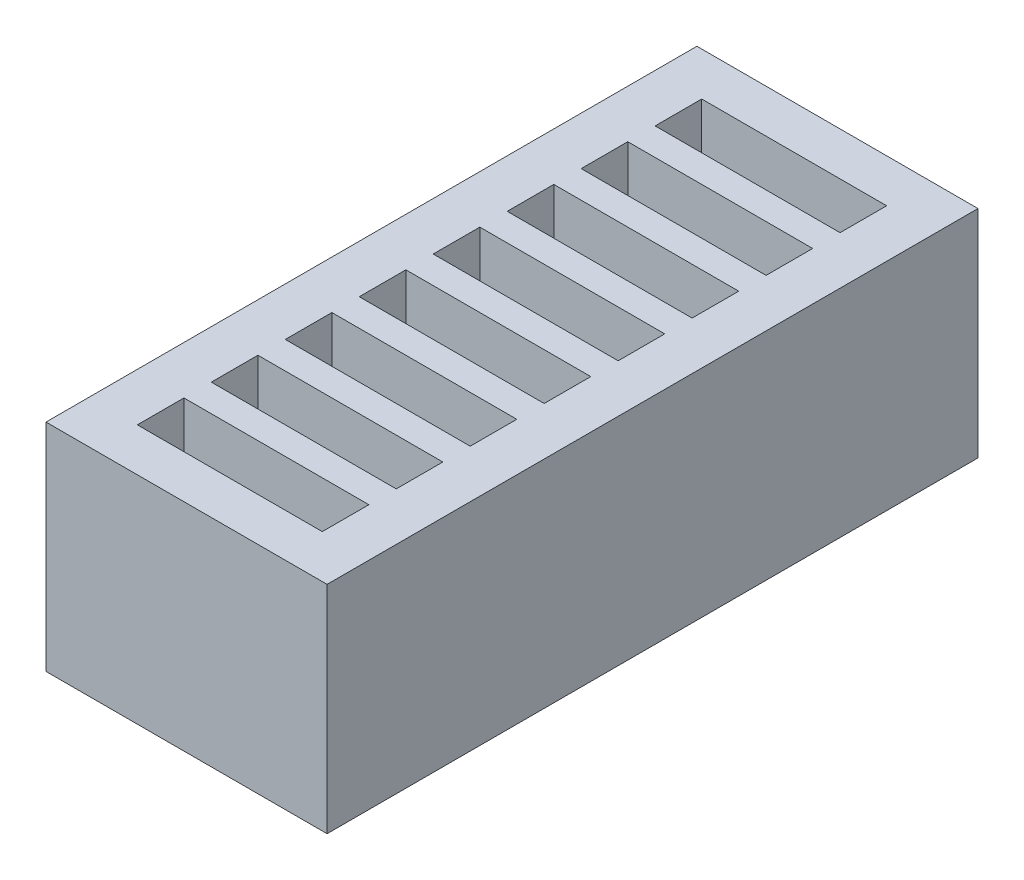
ISO-10303-21;
HEADER;
FILE_DESCRIPTION(('STEP AP214'),'2;1');
FILE_NAME('part.step','',(''),(''),'','','');
FILE_SCHEMA(('AUTOMOTIVE_DESIGN { 1 0 10303 214 1 1 1 1 }'));
ENDSEC;
DATA;
#1=APPLICATION_CONTEXT('core data for automotive mechanical design processes');
#2=APPLICATION_PROTOCOL_DEFINITION('international standard','automotive_design',2000,#1);
#3=PRODUCT_CONTEXT('',#1,'mechanical');
#4=PRODUCT('Part','Part','',(#3));
#5=PRODUCT_RELATED_PRODUCT_CATEGORY('part','',(#4));
#6=PRODUCT_DEFINITION_FORMATION('','',#4);
#7=PRODUCT_DEFINITION_CONTEXT('part definition',#1,'design');
#8=PRODUCT_DEFINITION('design','',#6,#7);
#9=PRODUCT_DEFINITION_SHAPE('','',#8);
#10=(LENGTH_UNIT() NAMED_UNIT(*) SI_UNIT(.MILLI.,.METRE.));
#11=(NAMED_UNIT(*) PLANE_ANGLE_UNIT() SI_UNIT($,.RADIAN.));
#12=(NAMED_UNIT(*) SI_UNIT($,.STERADIAN.) SOLID_ANGLE_UNIT());
#13=UNCERTAINTY_MEASURE_WITH_UNIT(LENGTH_MEASURE(1.E-05),#10,'distance_accuracy_value','');
#14=(GEOMETRIC_REPRESENTATION_CONTEXT(3) GLOBAL_UNCERTAINTY_ASSIGNED_CONTEXT((#13)) GLOBAL_UNIT_ASSIGNED_CONTEXT((#10,
#11,#12)) REPRESENTATION_CONTEXT('',''));
#15=CARTESIAN_POINT('',(0.,0.,0.));
#16=DIRECTION('',(0.,0.,1.));
#17=DIRECTION('',(1.,0.,0.));
#18=AXIS2_PLACEMENT_3D('',#15,#16,#17);
#19=CARTESIAN_POINT('',(0.,7.4168,0.));
#20=DIRECTION('',(1.,0.,0.));
#21=DIRECTION('',(0.,0.,-1.));
#22=AXIS2_PLACEMENT_3D('',#19,#20,#21);
#23=PLANE('',#22);
#24=DIRECTION('',(0.,0.,1.));
#25=VECTOR('',#24,1.);
#26=CARTESIAN_POINT('',(0.,0.,0.));
#27=LINE('',#26,#25);
#28=CARTESIAN_POINT('',(0.,0.,-22.352));
#29=VERTEX_POINT('',#28);
#30=CARTESIAN_POINT('',(0.,0.,0.));
#31=VERTEX_POINT('',#30);
#32=EDGE_CURVE('E518',#29,#31,#27,.T.);
#33=ORIENTED_EDGE('',*,*,#32,.T.);
#34=DIRECTION('',(0.,-1.,0.));
#35=VECTOR('',#34,1.);
#36=CARTESIAN_POINT('',(0.,7.4168,0.));
#37=LINE('',#36,#35);
#38=CARTESIAN_POINT('',(0.,7.4168,0.));
#39=VERTEX_POINT('',#38);
#40=EDGE_CURVE('E11',#39,#31,#37,.T.);
#41=ORIENTED_EDGE('',*,*,#40,.F.);
#42=DIRECTION('',(0.,0.,1.));
#43=VECTOR('',#42,1.);
#44=CARTESIAN_POINT('',(0.,7.4168,0.));
#45=LINE('',#44,#43);
#46=CARTESIAN_POINT('',(0.,7.4168,-22.352));
#47=VERTEX_POINT('',#46);
#48=EDGE_CURVE('E533',#47,#39,#45,.T.);
#49=ORIENTED_EDGE('',*,*,#48,.F.);
#50=DIRECTION('',(0.,-1.,0.));
#51=VECTOR('',#50,1.);
#52=CARTESIAN_POINT('',(0.,7.4168,-22.352));
#53=LINE('',#52,#51);
#54=EDGE_CURVE('E542',#47,#29,#53,.T.);
#55=ORIENTED_EDGE('',*,*,#54,.T.);
#56=EDGE_LOOP('',(#33,#41,#49,#55));
#57=FACE_BOUND('',#56,.T.);
#58=ADVANCED_FACE('F30',(#57),#23,.F.);
#59=CARTESIAN_POINT('',(0.,7.4168,0.));
#60=DIRECTION('',(0.,0.,-1.));
#61=DIRECTION('',(-1.,0.,0.));
#62=AXIS2_PLACEMENT_3D('',#59,#60,#61);
#63=PLANE('',#62);
#64=DIRECTION('',(1.,0.,0.));
#65=VECTOR('',#64,1.);
#66=CARTESIAN_POINT('',(0.,0.,0.));
#67=LINE('',#66,#65);
#68=CARTESIAN_POINT('',(9.652,0.,0.));
#69=VERTEX_POINT('',#68);
#70=EDGE_CURVE('E527',#31,#69,#67,.T.);
#71=ORIENTED_EDGE('',*,*,#70,.T.);
#72=DIRECTION('',(0.,-1.,0.));
#73=VECTOR('',#72,1.);
#74=CARTESIAN_POINT('',(9.652,7.4168,0.));
#75=LINE('',#74,#73);
#76=CARTESIAN_POINT('',(9.652,7.4168,0.));
#77=VERTEX_POINT('',#76);
#78=EDGE_CURVE('E37',#77,#69,#75,.T.);
#79=ORIENTED_EDGE('',*,*,#78,.F.);
#80=DIRECTION('',(1.,0.,0.));
#81=VECTOR('',#80,1.);
#82=CARTESIAN_POINT('',(0.,7.4168,0.));
#83=LINE('',#82,#81);
#84=EDGE_CURVE('E536',#39,#77,#83,.T.);
#85=ORIENTED_EDGE('',*,*,#84,.F.);
#86=ORIENTED_EDGE('',*,*,#40,.T.);
#87=EDGE_LOOP('',(#71,#79,#85,#86));
#88=FACE_BOUND('',#87,.T.);
#89=ADVANCED_FACE('F567',(#88),#63,.F.);
#90=CARTESIAN_POINT('',(9.652,7.4168,0.));
#91=DIRECTION('',(-1.,0.,0.));
#92=DIRECTION('',(0.,0.,1.));
#93=AXIS2_PLACEMENT_3D('',#90,#91,#92);
#94=PLANE('',#93);
#95=DIRECTION('',(0.,0.,-1.));
#96=VECTOR('',#95,1.);
#97=CARTESIAN_POINT('',(9.652,0.,0.));
#98=LINE('',#97,#96);
#99=CARTESIAN_POINT('',(9.652,0.,-22.352));
#100=VERTEX_POINT('',#99);
#101=EDGE_CURVE('E529',#69,#100,#98,.T.);
#102=ORIENTED_EDGE('',*,*,#101,.T.);
#103=DIRECTION('',(0.,-1.,0.));
#104=VECTOR('',#103,1.);
#105=CARTESIAN_POINT('',(9.652,7.4168,-22.352));
#106=LINE('',#105,#104);
#107=CARTESIAN_POINT('',(9.652,7.4168,-22.352));
#108=VERTEX_POINT('',#107);
#109=EDGE_CURVE('E545',#108,#100,#106,.T.);
#110=ORIENTED_EDGE('',*,*,#109,.F.);
#111=DIRECTION('',(0.,0.,-1.));
#112=VECTOR('',#111,1.);
#113=CARTESIAN_POINT('',(9.652,7.4168,0.));
#114=LINE('',#113,#112);
#115=EDGE_CURVE('E538',#77,#108,#114,.T.);
#116=ORIENTED_EDGE('',*,*,#115,.F.);
#117=ORIENTED_EDGE('',*,*,#78,.T.);
#118=EDGE_LOOP('',(#102,#110,#116,#117));
#119=FACE_BOUND('',#118,.T.);
#120=ADVANCED_FACE('F552',(#119),#94,.F.);
#121=CARTESIAN_POINT('',(0.,7.4168,-22.352));
#122=DIRECTION('',(0.,0.,1.));
#123=DIRECTION('',(1.,0.,0.));
#124=AXIS2_PLACEMENT_3D('',#121,#122,#123);
#125=PLANE('',#124);
#126=DIRECTION('',(-1.,0.,0.));
#127=VECTOR('',#126,1.);
#128=CARTESIAN_POINT('',(0.,0.,-22.352));
#129=LINE('',#128,#127);
#130=EDGE_CURVE('E531',#100,#29,#129,.T.);
#131=ORIENTED_EDGE('',*,*,#130,.T.);
#132=ORIENTED_EDGE('',*,*,#54,.F.);
#133=DIRECTION('',(-1.,0.,0.));
#134=VECTOR('',#133,1.);
#135=CARTESIAN_POINT('',(0.,7.4168,-22.352));
#136=LINE('',#135,#134);
#137=EDGE_CURVE('E540',#108,#47,#136,.T.);
#138=ORIENTED_EDGE('',*,*,#137,.F.);
#139=ORIENTED_EDGE('',*,*,#109,.T.);
#140=EDGE_LOOP('',(#131,#132,#138,#139));
#141=FACE_BOUND('',#140,.T.);
#142=ADVANCED_FACE('F561',(#141),#125,.F.);
#143=CARTESIAN_POINT('',(0.,7.4168,-22.352));
#144=DIRECTION('',(0.,-1.,0.));
#145=DIRECTION('',(0.,0.,-1.));
#146=AXIS2_PLACEMENT_3D('',#143,#144,#145);
#147=PLANE('',#146);
#148=DIRECTION('',(0.,0.,1.));
#149=VECTOR('',#148,1.);
#150=CARTESIAN_POINT('',(1.651,7.4168,-13.2461));
#151=LINE('',#150,#149);
#152=CARTESIAN_POINT('',(1.651,7.4168,-13.2461));
#153=VERTEX_POINT('',#152);
#154=CARTESIAN_POINT('',(1.651,7.4168,-11.6459));
#155=VERTEX_POINT('',#154);
#156=EDGE_CURVE('E277',#153,#155,#151,.T.);
#157=ORIENTED_EDGE('',*,*,#156,.F.);
#158=DIRECTION('',(-1.,0.,0.));
#159=VECTOR('',#158,1.);
#160=CARTESIAN_POINT('',(8.001,7.4168,-13.2461));
#161=LINE('',#160,#159);
#162=CARTESIAN_POINT('',(8.001,7.4168,-13.2461));
#163=VERTEX_POINT('',#162);
#164=EDGE_CURVE('E44',#163,#153,#161,.T.);
#165=ORIENTED_EDGE('',*,*,#164,.F.);
#166=DIRECTION('',(0.,0.,-1.));
#167=VECTOR('',#166,1.);
#168=CARTESIAN_POINT('',(8.001,7.4168,-13.2461));
#169=LINE('',#168,#167);
#170=CARTESIAN_POINT('',(8.001,7.4168,-11.6459));
#171=VERTEX_POINT('',#170);
#172=EDGE_CURVE('E284',#171,#163,#169,.T.);
#173=ORIENTED_EDGE('',*,*,#172,.F.);
#174=DIRECTION('',(1.,0.,0.));
#175=VECTOR('',#174,1.);
#176=CARTESIAN_POINT('',(8.001,7.4168,-11.6459));
#177=LINE('',#176,#175);
#178=EDGE_CURVE('E266',#155,#171,#177,.T.);
#179=ORIENTED_EDGE('',*,*,#178,.F.);
#180=EDGE_LOOP('',(#157,#165,#173,#179));
#181=FACE_BOUND('',#180,.T.);
#182=DIRECTION('',(0.,0.,1.));
#183=VECTOR('',#182,1.);
#184=CARTESIAN_POINT('',(1.65100000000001,7.4168,-15.7861));
#185=LINE('',#184,#183);
#186=CARTESIAN_POINT('',(1.65100000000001,7.4168,-15.7861));
#187=VERTEX_POINT('',#186);
#188=CARTESIAN_POINT('',(1.65100000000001,7.4168,-14.1859));
#189=VERTEX_POINT('',#188);
#190=EDGE_CURVE('E303',#187,#189,#185,.T.);
#191=ORIENTED_EDGE('',*,*,#190,.F.);
#192=DIRECTION('',(-1.,0.,0.));
#193=VECTOR('',#192,1.);
#194=CARTESIAN_POINT('',(8.00100000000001,7.4168,-15.7861));
#195=LINE('',#194,#193);
#196=CARTESIAN_POINT('',(8.00100000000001,7.4168,-15.7861));
#197=VERTEX_POINT('',#196);
#198=EDGE_CURVE('E52',#197,#187,#195,.T.);
#199=ORIENTED_EDGE('',*,*,#198,.F.);
#200=DIRECTION('',(0.,0.,-1.));
#201=VECTOR('',#200,1.);
#202=CARTESIAN_POINT('',(8.00100000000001,7.4168,-15.7861));
#203=LINE('',#202,#201);
#204=CARTESIAN_POINT('',(8.00100000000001,7.4168,-14.1859));
#205=VERTEX_POINT('',#204);
#206=EDGE_CURVE('E309',#205,#197,#203,.T.);
#207=ORIENTED_EDGE('',*,*,#206,.F.);
#208=DIRECTION('',(1.,0.,0.));
#209=VECTOR('',#208,1.);
#210=CARTESIAN_POINT('',(8.00100000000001,7.4168,-14.1859));
#211=LINE('',#210,#209);
#212=EDGE_CURVE('E306',#189,#205,#211,.T.);
#213=ORIENTED_EDGE('',*,*,#212,.F.);
#214=EDGE_LOOP('',(#191,#199,#207,#213));
#215=FACE_BOUND('',#214,.T.);
#216=DIRECTION('',(0.,0.,1.));
#217=VECTOR('',#216,1.);
#218=CARTESIAN_POINT('',(1.65100000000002,7.4168,-18.3261));
#219=LINE('',#218,#217);
#220=CARTESIAN_POINT('',(1.65100000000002,7.4168,-18.3261));
#221=VERTEX_POINT('',#220);
#222=CARTESIAN_POINT('',(1.65100000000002,7.4168,-16.7259));
#223=VERTEX_POINT('',#222);
#224=EDGE_CURVE('E334',#221,#223,#219,.T.);
#225=ORIENTED_EDGE('',*,*,#224,.F.);
#226=DIRECTION('',(-1.,0.,0.));
#227=VECTOR('',#226,1.);
#228=CARTESIAN_POINT('',(8.00100000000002,7.4168,-18.3261));
#229=LINE('',#228,#227);
#230=CARTESIAN_POINT('',(8.00100000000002,7.4168,-18.3261));
#231=VERTEX_POINT('',#230);
#232=EDGE_CURVE('E327',#231,#221,#229,.T.);
#233=ORIENTED_EDGE('',*,*,#232,.F.);
#234=DIRECTION('',(0.,0.,-1.));
#235=VECTOR('',#234,1.);
#236=CARTESIAN_POINT('',(8.00100000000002,7.4168,-18.3261));
#237=LINE('',#236,#235);
#238=CARTESIAN_POINT('',(8.00100000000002,7.4168,-16.7259));
#239=VERTEX_POINT('',#238);
#240=EDGE_CURVE('E340',#239,#231,#237,.T.);
#241=ORIENTED_EDGE('',*,*,#240,.F.);
#242=DIRECTION('',(1.,0.,0.));
#243=VECTOR('',#242,1.);
#244=CARTESIAN_POINT('',(8.00100000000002,7.4168,-16.7259));
#245=LINE('',#244,#243);
#246=EDGE_CURVE('E337',#223,#239,#245,.T.);
#247=ORIENTED_EDGE('',*,*,#246,.F.);
#248=EDGE_LOOP('',(#225,#233,#241,#247));
#249=FACE_BOUND('',#248,.T.);
#250=DIRECTION('',(-1.,0.,0.));
#251=VECTOR('',#250,1.);
#252=CARTESIAN_POINT('',(8.00100000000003,7.4168,-3.0861));
#253=LINE('',#252,#251);
#254=CARTESIAN_POINT('',(8.00100000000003,7.4168,-3.0861));
#255=VERTEX_POINT('',#254);
#256=CARTESIAN_POINT('',(1.65100000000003,7.4168,-3.0861));
#257=VERTEX_POINT('',#256);
#258=EDGE_CURVE('E366',#255,#257,#253,.T.);
#259=ORIENTED_EDGE('',*,*,#258,.F.);
#260=DIRECTION('',(0.,0.,-1.));
#261=VECTOR('',#260,1.);
#262=CARTESIAN_POINT('',(8.00100000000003,7.4168,-1.4859));
#263=LINE('',#262,#261);
#264=CARTESIAN_POINT('',(8.00100000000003,7.4168,-1.4859));
#265=VERTEX_POINT('',#264);
#266=EDGE_CURVE('E358',#265,#255,#263,.T.);
#267=ORIENTED_EDGE('',*,*,#266,.F.);
#268=DIRECTION('',(1.,0.,0.));
#269=VECTOR('',#268,1.);
#270=CARTESIAN_POINT('',(8.00100000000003,7.4168,-1.4859));
#271=LINE('',#270,#269);
#272=CARTESIAN_POINT('',(1.65100000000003,7.4168,-1.4859));
#273=VERTEX_POINT('',#272);
#274=EDGE_CURVE('E372',#273,#265,#271,.T.);
#275=ORIENTED_EDGE('',*,*,#274,.F.);
#276=DIRECTION('',(0.,0.,1.));
#277=VECTOR('',#276,1.);
#278=CARTESIAN_POINT('',(1.65100000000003,7.4168,-1.4859));
#279=LINE('',#278,#277);
#280=EDGE_CURVE('E369',#257,#273,#279,.T.);
#281=ORIENTED_EDGE('',*,*,#280,.F.);
#282=EDGE_LOOP('',(#259,#267,#275,#281));
#283=FACE_BOUND('',#282,.T.);
#284=DIRECTION('',(-1.,0.,0.));
#285=VECTOR('',#284,1.);
#286=CARTESIAN_POINT('',(8.00100000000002,7.4168,-5.6261));
#287=LINE('',#286,#285);
#288=CARTESIAN_POINT('',(8.00100000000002,7.4168,-5.6261));
#289=VERTEX_POINT('',#288);
#290=CARTESIAN_POINT('',(1.65100000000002,7.4168,-5.6261));
#291=VERTEX_POINT('',#290);
#292=EDGE_CURVE('E398',#289,#291,#287,.T.);
#293=ORIENTED_EDGE('',*,*,#292,.F.);
#294=DIRECTION('',(0.,0.,-1.));
#295=VECTOR('',#294,1.);
#296=CARTESIAN_POINT('',(8.00100000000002,7.4168,-4.0259));
#297=LINE('',#296,#295);
#298=CARTESIAN_POINT('',(8.00100000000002,7.4168,-4.0259));
#299=VERTEX_POINT('',#298);
#300=EDGE_CURVE('E390',#299,#289,#297,.T.);
#301=ORIENTED_EDGE('',*,*,#300,.F.);
#302=DIRECTION('',(1.,0.,0.));
#303=VECTOR('',#302,1.);
#304=CARTESIAN_POINT('',(8.00100000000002,7.4168,-4.0259));
#305=LINE('',#304,#303);
#306=CARTESIAN_POINT('',(1.65100000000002,7.4168,-4.0259));
#307=VERTEX_POINT('',#306);
#308=EDGE_CURVE('E404',#307,#299,#305,.T.);
#309=ORIENTED_EDGE('',*,*,#308,.F.);
#310=DIRECTION('',(0.,0.,1.));
#311=VECTOR('',#310,1.);
#312=CARTESIAN_POINT('',(1.65100000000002,7.4168,-4.0259));
#313=LINE('',#312,#311);
#314=EDGE_CURVE('E401',#291,#307,#313,.T.);
#315=ORIENTED_EDGE('',*,*,#314,.F.);
#316=EDGE_LOOP('',(#293,#301,#309,#315));
#317=FACE_BOUND('',#316,.T.);
#318=DIRECTION('',(-1.,0.,0.));
#319=VECTOR('',#318,1.);
#320=CARTESIAN_POINT('',(8.00100000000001,7.4168,-8.1661));
#321=LINE('',#320,#319);
#322=CARTESIAN_POINT('',(8.00100000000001,7.4168,-8.1661));
#323=VERTEX_POINT('',#322);
#324=CARTESIAN_POINT('',(1.65100000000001,7.4168,-8.1661));
#325=VERTEX_POINT('',#324);
#326=EDGE_CURVE('E430',#323,#325,#321,.T.);
#327=ORIENTED_EDGE('',*,*,#326,.F.);
#328=DIRECTION('',(0.,0.,-1.));
#329=VECTOR('',#328,1.);
#330=CARTESIAN_POINT('',(8.00100000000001,7.4168,-6.5659));
#331=LINE('',#330,#329);
#332=CARTESIAN_POINT('',(8.00100000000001,7.4168,-6.5659));
#333=VERTEX_POINT('',#332);
#334=EDGE_CURVE('E422',#333,#323,#331,.T.);
#335=ORIENTED_EDGE('',*,*,#334,.F.);
#336=DIRECTION('',(1.,0.,0.));
#337=VECTOR('',#336,1.);
#338=CARTESIAN_POINT('',(8.00100000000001,7.4168,-6.5659));
#339=LINE('',#338,#337);
#340=CARTESIAN_POINT('',(1.65100000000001,7.4168,-6.5659));
#341=VERTEX_POINT('',#340);
#342=EDGE_CURVE('E436',#341,#333,#339,.T.);
#343=ORIENTED_EDGE('',*,*,#342,.F.);
#344=DIRECTION('',(0.,0.,1.));
#345=VECTOR('',#344,1.);
#346=CARTESIAN_POINT('',(1.65100000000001,7.4168,-6.5659));
#347=LINE('',#346,#345);
#348=EDGE_CURVE('E433',#325,#341,#347,.T.);
#349=ORIENTED_EDGE('',*,*,#348,.F.);
#350=EDGE_LOOP('',(#327,#335,#343,#349));
#351=FACE_BOUND('',#350,.T.);
#352=DIRECTION('',(0.,0.,1.));
#353=VECTOR('',#352,1.);
#354=CARTESIAN_POINT('',(1.65100000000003,7.4168,-20.8661));
#355=LINE('',#354,#353);
#356=CARTESIAN_POINT('',(1.65100000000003,7.4168,-20.8661));
#357=VERTEX_POINT('',#356);
#358=CARTESIAN_POINT('',(1.65100000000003,7.4168,-19.2659));
#359=VERTEX_POINT('',#358);
#360=EDGE_CURVE('E462',#357,#359,#355,.T.);
#361=ORIENTED_EDGE('',*,*,#360,.F.);
#362=DIRECTION('',(-1.,0.,0.));
#363=VECTOR('',#362,1.);
#364=CARTESIAN_POINT('',(8.00100000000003,7.4168,-20.8661));
#365=LINE('',#364,#363);
#366=CARTESIAN_POINT('',(8.00100000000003,7.4168,-20.8661));
#367=VERTEX_POINT('',#366);
#368=EDGE_CURVE('E454',#367,#357,#365,.T.);
#369=ORIENTED_EDGE('',*,*,#368,.F.);
#370=DIRECTION('',(0.,0.,-1.));
#371=VECTOR('',#370,1.);
#372=CARTESIAN_POINT('',(8.00100000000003,7.4168,-20.8661));
#373=LINE('',#372,#371);
#374=CARTESIAN_POINT('',(8.00100000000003,7.4168,-19.2659));
#375=VERTEX_POINT('',#374);
#376=EDGE_CURVE('E468',#375,#367,#373,.T.);
#377=ORIENTED_EDGE('',*,*,#376,.F.);
#378=DIRECTION('',(1.,0.,0.));
#379=VECTOR('',#378,1.);
#380=CARTESIAN_POINT('',(8.00100000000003,7.4168,-19.2659));
#381=LINE('',#380,#379);
#382=EDGE_CURVE('E465',#359,#375,#381,.T.);
#383=ORIENTED_EDGE('',*,*,#382,.F.);
#384=EDGE_LOOP('',(#361,#369,#377,#383));
#385=FACE_BOUND('',#384,.T.);
#386=DIRECTION('',(-1.,0.,0.));
#387=VECTOR('',#386,1.);
#388=CARTESIAN_POINT('',(8.001,7.4168,-10.7061));
#389=LINE('',#388,#387);
#390=CARTESIAN_POINT('',(8.001,7.4168,-10.7061));
#391=VERTEX_POINT('',#390);
#392=CARTESIAN_POINT('',(1.651,7.4168,-10.7061));
#393=VERTEX_POINT('',#392);
#394=EDGE_CURVE('E494',#391,#393,#389,.T.);
#395=ORIENTED_EDGE('',*,*,#394,.F.);
#396=DIRECTION('',(0.,0.,-1.));
#397=VECTOR('',#396,1.);
#398=CARTESIAN_POINT('',(8.001,7.4168,-9.1059));
#399=LINE('',#398,#397);
#400=CARTESIAN_POINT('',(8.001,7.4168,-9.1059));
#401=VERTEX_POINT('',#400);
#402=EDGE_CURVE('E486',#401,#391,#399,.T.);
#403=ORIENTED_EDGE('',*,*,#402,.F.);
#404=DIRECTION('',(1.,0.,0.));
#405=VECTOR('',#404,1.);
#406=CARTESIAN_POINT('',(8.001,7.4168,-9.1059));
#407=LINE('',#406,#405);
#408=CARTESIAN_POINT('',(1.651,7.4168,-9.1059));
#409=VERTEX_POINT('',#408);
#410=EDGE_CURVE('E500',#409,#401,#407,.T.);
#411=ORIENTED_EDGE('',*,*,#410,.F.);
#412=DIRECTION('',(0.,0.,1.));
#413=VECTOR('',#412,1.);
#414=CARTESIAN_POINT('',(1.651,7.4168,-9.1059));
#415=LINE('',#414,#413);
#416=EDGE_CURVE('E497',#393,#409,#415,.T.);
#417=ORIENTED_EDGE('',*,*,#416,.F.);
#418=EDGE_LOOP('',(#395,#403,#411,#417));
#419=FACE_BOUND('',#418,.T.);
#420=ORIENTED_EDGE('',*,*,#48,.T.);
#421=ORIENTED_EDGE('',*,*,#84,.T.);
#422=ORIENTED_EDGE('',*,*,#115,.T.);
#423=ORIENTED_EDGE('',*,*,#137,.T.);
#424=EDGE_LOOP('',(#420,#421,#422,#423));
#425=FACE_BOUND('',#424,.T.);
#426=ADVANCED_FACE('F281',(#181,#215,#249,#283,#317,#351,#385,#419,#425),#147,.F.);
#427=CARTESIAN_POINT('',(0.,0.,-22.352));
#428=DIRECTION('',(0.,-1.,0.));
#429=DIRECTION('',(0.,0.,-1.));
#430=AXIS2_PLACEMENT_3D('',#427,#428,#429);
#431=PLANE('',#430);
#432=ORIENTED_EDGE('',*,*,#32,.F.);
#433=ORIENTED_EDGE('',*,*,#130,.F.);
#434=ORIENTED_EDGE('',*,*,#101,.F.);
#435=ORIENTED_EDGE('',*,*,#70,.F.);
#436=EDGE_LOOP('',(#432,#433,#434,#435));
#437=FACE_BOUND('',#436,.T.);
#438=ADVANCED_FACE('F558',(#437),#431,.T.);
#439=CARTESIAN_POINT('',(8.001,5.8166,-9.1059));
#440=DIRECTION('',(1.,0.,0.));
#441=DIRECTION('',(0.,0.,-1.));
#442=AXIS2_PLACEMENT_3D('',#439,#440,#441);
#443=PLANE('',#442);
#444=ORIENTED_EDGE('',*,*,#402,.T.);
#445=DIRECTION('',(0.,1.,0.));
#446=VECTOR('',#445,1.);
#447=CARTESIAN_POINT('',(8.001,5.8166,-10.7061));
#448=LINE('',#447,#446);
#449=CARTESIAN_POINT('',(8.001,5.8166,-10.7061));
#450=VERTEX_POINT('',#449);
#451=EDGE_CURVE('E515',#450,#391,#448,.T.);
#452=ORIENTED_EDGE('',*,*,#451,.F.);
#453=DIRECTION('',(0.,0.,-1.));
#454=VECTOR('',#453,1.);
#455=CARTESIAN_POINT('',(8.001,5.8166,-9.1059));
#456=LINE('',#455,#454);
#457=CARTESIAN_POINT('',(8.001,5.8166,-9.1059));
#458=VERTEX_POINT('',#457);
#459=EDGE_CURVE('E503',#458,#450,#456,.T.);
#460=ORIENTED_EDGE('',*,*,#459,.F.);
#461=DIRECTION('',(0.,1.,0.));
#462=VECTOR('',#461,1.);
#463=CARTESIAN_POINT('',(8.001,5.8166,-9.1059));
#464=LINE('',#463,#462);
#465=EDGE_CURVE('E516',#458,#401,#464,.T.);
#466=ORIENTED_EDGE('',*,*,#465,.T.);
#467=EDGE_LOOP('',(#444,#452,#460,#466));
#468=FACE_BOUND('',#467,.T.);
#469=ADVANCED_FACE('F581',(#468),#443,.F.);
#470=CARTESIAN_POINT('',(8.001,5.8166,-9.1059));
#471=DIRECTION('',(0.,0.,1.));
#472=DIRECTION('',(1.,0.,0.));
#473=AXIS2_PLACEMENT_3D('',#470,#471,#472);
#474=PLANE('',#473);
#475=ORIENTED_EDGE('',*,*,#410,.T.);
#476=ORIENTED_EDGE('',*,*,#465,.F.);
#477=DIRECTION('',(1.,0.,0.));
#478=VECTOR('',#477,1.);
#479=CARTESIAN_POINT('',(8.001,5.8166,-9.1059));
#480=LINE('',#479,#478);
#481=CARTESIAN_POINT('',(1.651,5.8166,-9.1059));
#482=VERTEX_POINT('',#481);
#483=EDGE_CURVE('E512',#482,#458,#480,.T.);
#484=ORIENTED_EDGE('',*,*,#483,.F.);
#485=DIRECTION('',(0.,1.,0.));
#486=VECTOR('',#485,1.);
#487=CARTESIAN_POINT('',(1.651,5.8166,-9.1059));
#488=LINE('',#487,#486);
#489=EDGE_CURVE('E519',#482,#409,#488,.T.);
#490=ORIENTED_EDGE('',*,*,#489,.T.);
#491=EDGE_LOOP('',(#475,#476,#484,#490));
#492=FACE_BOUND('',#491,.T.);
#493=ADVANCED_FACE('F584',(#492),#474,.F.);
#494=CARTESIAN_POINT('',(1.651,5.8166,-9.1059));
#495=DIRECTION('',(-1.,0.,0.));
#496=DIRECTION('',(0.,0.,1.));
#497=AXIS2_PLACEMENT_3D('',#494,#495,#496);
#498=PLANE('',#497);
#499=ORIENTED_EDGE('',*,*,#416,.T.);
#500=ORIENTED_EDGE('',*,*,#489,.F.);
#501=DIRECTION('',(0.,0.,1.));
#502=VECTOR('',#501,1.);
#503=CARTESIAN_POINT('',(1.651,5.8166,-9.1059));
#504=LINE('',#503,#502);
#505=CARTESIAN_POINT('',(1.651,5.8166,-10.7061));
#506=VERTEX_POINT('',#505);
#507=EDGE_CURVE('E509',#506,#482,#504,.T.);
#508=ORIENTED_EDGE('',*,*,#507,.F.);
#509=DIRECTION('',(0.,1.,0.));
#510=VECTOR('',#509,1.);
#511=CARTESIAN_POINT('',(1.651,5.8166,-10.7061));
#512=LINE('',#511,#510);
#513=EDGE_CURVE('E521',#506,#393,#512,.T.);
#514=ORIENTED_EDGE('',*,*,#513,.T.);
#515=EDGE_LOOP('',(#499,#500,#508,#514));
#516=FACE_BOUND('',#515,.T.);
#517=ADVANCED_FACE('F590',(#516),#498,.F.);
#518=CARTESIAN_POINT('',(8.001,5.8166,-10.7061));
#519=DIRECTION('',(0.,0.,-1.));
#520=DIRECTION('',(-1.,0.,0.));
#521=AXIS2_PLACEMENT_3D('',#518,#519,#520);
#522=PLANE('',#521);
#523=ORIENTED_EDGE('',*,*,#394,.T.);
#524=ORIENTED_EDGE('',*,*,#513,.F.);
#525=DIRECTION('',(-1.,0.,0.));
#526=VECTOR('',#525,1.);
#527=CARTESIAN_POINT('',(8.001,5.8166,-10.7061));
#528=LINE('',#527,#526);
#529=EDGE_CURVE('E506',#450,#506,#528,.T.);
#530=ORIENTED_EDGE('',*,*,#529,.F.);
#531=ORIENTED_EDGE('',*,*,#451,.T.);
#532=EDGE_LOOP('',(#523,#524,#530,#531));
#533=FACE_BOUND('',#532,.T.);
#534=ADVANCED_FACE('F586',(#533),#522,.F.);
#535=CARTESIAN_POINT('',(8.001,5.8166,-10.7061));
#536=DIRECTION('',(0.,1.,0.));
#537=DIRECTION('',(0.,0.,1.));
#538=AXIS2_PLACEMENT_3D('',#535,#536,#537);
#539=PLANE('',#538);
#540=ORIENTED_EDGE('',*,*,#459,.T.);
#541=ORIENTED_EDGE('',*,*,#529,.T.);
#542=ORIENTED_EDGE('',*,*,#507,.T.);
#543=ORIENTED_EDGE('',*,*,#483,.T.);
#544=EDGE_LOOP('',(#540,#541,#542,#543));
#545=FACE_BOUND('',#544,.T.);
#546=ADVANCED_FACE('F589',(#545),#539,.T.);
#547=CARTESIAN_POINT('',(8.00100000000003,5.8166,-20.8661));
#548=DIRECTION('',(0.,0.,-1.));
#549=DIRECTION('',(-1.,0.,0.));
#550=AXIS2_PLACEMENT_3D('',#547,#548,#549);
#551=PLANE('',#550);
#552=ORIENTED_EDGE('',*,*,#368,.T.);
#553=DIRECTION('',(0.,1.,0.));
#554=VECTOR('',#553,1.);
#555=CARTESIAN_POINT('',(1.65100000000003,5.8166,-20.8661));
#556=LINE('',#555,#554);
#557=CARTESIAN_POINT('',(1.65100000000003,5.8166,-20.8661));
#558=VERTEX_POINT('',#557);
#559=EDGE_CURVE('E483',#558,#357,#556,.T.);
#560=ORIENTED_EDGE('',*,*,#559,.F.);
#561=DIRECTION('',(-1.,0.,0.));
#562=VECTOR('',#561,1.);
#563=CARTESIAN_POINT('',(8.00100000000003,5.8166,-20.8661));
#564=LINE('',#563,#562);
#565=CARTESIAN_POINT('',(8.00100000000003,5.8166,-20.8661));
#566=VERTEX_POINT('',#565);
#567=EDGE_CURVE('E471',#566,#558,#564,.T.);
#568=ORIENTED_EDGE('',*,*,#567,.F.);
#569=DIRECTION('',(0.,1.,0.));
#570=VECTOR('',#569,1.);
#571=CARTESIAN_POINT('',(8.00100000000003,5.8166,-20.8661));
#572=LINE('',#571,#570);
#573=EDGE_CURVE('E484',#566,#367,#572,.T.);
#574=ORIENTED_EDGE('',*,*,#573,.T.);
#575=EDGE_LOOP('',(#552,#560,#568,#574));
#576=FACE_BOUND('',#575,.T.);
#577=ADVANCED_FACE('F600',(#576),#551,.F.);
#578=CARTESIAN_POINT('',(8.00100000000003,5.8166,-20.8661));
#579=DIRECTION('',(1.,0.,0.));
#580=DIRECTION('',(0.,0.,-1.));
#581=AXIS2_PLACEMENT_3D('',#578,#579,#580);
#582=PLANE('',#581);
#583=ORIENTED_EDGE('',*,*,#376,.T.);
#584=ORIENTED_EDGE('',*,*,#573,.F.);
#585=DIRECTION('',(0.,0.,-1.));
#586=VECTOR('',#585,1.);
#587=CARTESIAN_POINT('',(8.00100000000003,5.8166,-20.8661));
#588=LINE('',#587,#586);
#589=CARTESIAN_POINT('',(8.00100000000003,5.8166,-19.2659));
#590=VERTEX_POINT('',#589);
#591=EDGE_CURVE('E480',#590,#566,#588,.T.);
#592=ORIENTED_EDGE('',*,*,#591,.F.);
#593=DIRECTION('',(0.,1.,0.));
#594=VECTOR('',#593,1.);
#595=CARTESIAN_POINT('',(8.00100000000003,5.8166,-19.2659));
#596=LINE('',#595,#594);
#597=EDGE_CURVE('E487',#590,#375,#596,.T.);
#598=ORIENTED_EDGE('',*,*,#597,.T.);
#599=EDGE_LOOP('',(#583,#584,#592,#598));
#600=FACE_BOUND('',#599,.T.);
#601=ADVANCED_FACE('F604',(#600),#582,.F.);
#602=CARTESIAN_POINT('',(8.00100000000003,5.8166,-19.2659));
#603=DIRECTION('',(0.,0.,1.));
#604=DIRECTION('',(1.,0.,0.));
#605=AXIS2_PLACEMENT_3D('',#602,#603,#604);
#606=PLANE('',#605);
#607=ORIENTED_EDGE('',*,*,#382,.T.);
#608=ORIENTED_EDGE('',*,*,#597,.F.);
#609=DIRECTION('',(1.,0.,0.));
#610=VECTOR('',#609,1.);
#611=CARTESIAN_POINT('',(8.00100000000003,5.8166,-19.2659));
#612=LINE('',#611,#610);
#613=CARTESIAN_POINT('',(1.65100000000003,5.8166,-19.2659));
#614=VERTEX_POINT('',#613);
#615=EDGE_CURVE('E477',#614,#590,#612,.T.);
#616=ORIENTED_EDGE('',*,*,#615,.F.);
#617=DIRECTION('',(0.,1.,0.));
#618=VECTOR('',#617,1.);
#619=CARTESIAN_POINT('',(1.65100000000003,5.8166,-19.2659));
#620=LINE('',#619,#618);
#621=EDGE_CURVE('E489',#614,#359,#620,.T.);
#622=ORIENTED_EDGE('',*,*,#621,.T.);
#623=EDGE_LOOP('',(#607,#608,#616,#622));
#624=FACE_BOUND('',#623,.T.);
#625=ADVANCED_FACE('F610',(#624),#606,.F.);
#626=CARTESIAN_POINT('',(1.65100000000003,5.8166,-20.8661));
#627=DIRECTION('',(-1.,0.,0.));
#628=DIRECTION('',(0.,0.,1.));
#629=AXIS2_PLACEMENT_3D('',#626,#627,#628);
#630=PLANE('',#629);
#631=ORIENTED_EDGE('',*,*,#360,.T.);
#632=ORIENTED_EDGE('',*,*,#621,.F.);
#633=DIRECTION('',(0.,0.,1.));
#634=VECTOR('',#633,1.);
#635=CARTESIAN_POINT('',(1.65100000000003,5.8166,-20.8661));
#636=LINE('',#635,#634);
#637=EDGE_CURVE('E474',#558,#614,#636,.T.);
#638=ORIENTED_EDGE('',*,*,#637,.F.);
#639=ORIENTED_EDGE('',*,*,#559,.T.);
#640=EDGE_LOOP('',(#631,#632,#638,#639));
#641=FACE_BOUND('',#640,.T.);
#642=ADVANCED_FACE('F606',(#641),#630,.F.);
#643=CARTESIAN_POINT('',(8.00100000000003,5.8166,-20.8661));
#644=DIRECTION('',(0.,1.,0.));
#645=DIRECTION('',(0.,0.,1.));
#646=AXIS2_PLACEMENT_3D('',#643,#644,#645);
#647=PLANE('',#646);
#648=ORIENTED_EDGE('',*,*,#567,.T.);
#649=ORIENTED_EDGE('',*,*,#637,.T.);
#650=ORIENTED_EDGE('',*,*,#615,.T.);
#651=ORIENTED_EDGE('',*,*,#591,.T.);
#652=EDGE_LOOP('',(#648,#649,#650,#651));
#653=FACE_BOUND('',#652,.T.);
#654=ADVANCED_FACE('F609',(#653),#647,.T.);
#655=CARTESIAN_POINT('',(8.00100000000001,5.8166,-6.5659));
#656=DIRECTION('',(1.,0.,0.));
#657=DIRECTION('',(0.,0.,-1.));
#658=AXIS2_PLACEMENT_3D('',#655,#656,#657);
#659=PLANE('',#658);
#660=ORIENTED_EDGE('',*,*,#334,.T.);
#661=DIRECTION('',(0.,1.,0.));
#662=VECTOR('',#661,1.);
#663=CARTESIAN_POINT('',(8.00100000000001,5.8166,-8.1661));
#664=LINE('',#663,#662);
#665=CARTESIAN_POINT('',(8.00100000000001,5.8166,-8.1661));
#666=VERTEX_POINT('',#665);
#667=EDGE_CURVE('E451',#666,#323,#664,.T.);
#668=ORIENTED_EDGE('',*,*,#667,.F.);
#669=DIRECTION('',(0.,0.,-1.));
#670=VECTOR('',#669,1.);
#671=CARTESIAN_POINT('',(8.00100000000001,5.8166,-6.5659));
#672=LINE('',#671,#670);
#673=CARTESIAN_POINT('',(8.00100000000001,5.8166,-6.5659));
#674=VERTEX_POINT('',#673);
#675=EDGE_CURVE('E439',#674,#666,#672,.T.);
#676=ORIENTED_EDGE('',*,*,#675,.F.);
#677=DIRECTION('',(0.,1.,0.));
#678=VECTOR('',#677,1.);
#679=CARTESIAN_POINT('',(8.00100000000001,5.8166,-6.5659));
#680=LINE('',#679,#678);
#681=EDGE_CURVE('E452',#674,#333,#680,.T.);
#682=ORIENTED_EDGE('',*,*,#681,.T.);
#683=EDGE_LOOP('',(#660,#668,#676,#682));
#684=FACE_BOUND('',#683,.T.);
#685=ADVANCED_FACE('F620',(#684),#659,.F.);
#686=CARTESIAN_POINT('',(8.00100000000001,5.8166,-6.5659));
#687=DIRECTION('',(0.,0.,1.));
#688=DIRECTION('',(1.,0.,0.));
#689=AXIS2_PLACEMENT_3D('',#686,#687,#688);
#690=PLANE('',#689);
#691=ORIENTED_EDGE('',*,*,#342,.T.);
#692=ORIENTED_EDGE('',*,*,#681,.F.);
#693=DIRECTION('',(1.,0.,0.));
#694=VECTOR('',#693,1.);
#695=CARTESIAN_POINT('',(8.00100000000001,5.8166,-6.5659));
#696=LINE('',#695,#694);
#697=CARTESIAN_POINT('',(1.65100000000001,5.8166,-6.5659));
#698=VERTEX_POINT('',#697);
#699=EDGE_CURVE('E448',#698,#674,#696,.T.);
#700=ORIENTED_EDGE('',*,*,#699,.F.);
#701=DIRECTION('',(0.,1.,0.));
#702=VECTOR('',#701,1.);
#703=CARTESIAN_POINT('',(1.65100000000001,5.8166,-6.5659));
#704=LINE('',#703,#702);
#705=EDGE_CURVE('E455',#698,#341,#704,.T.);
#706=ORIENTED_EDGE('',*,*,#705,.T.);
#707=EDGE_LOOP('',(#691,#692,#700,#706));
#708=FACE_BOUND('',#707,.T.);
#709=ADVANCED_FACE('F624',(#708),#690,.F.);
#710=CARTESIAN_POINT('',(1.65100000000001,5.8166,-6.5659));
#711=DIRECTION('',(-1.,0.,0.));
#712=DIRECTION('',(0.,0.,1.));
#713=AXIS2_PLACEMENT_3D('',#710,#711,#712);
#714=PLANE('',#713);
#715=ORIENTED_EDGE('',*,*,#348,.T.);
#716=ORIENTED_EDGE('',*,*,#705,.F.);
#717=DIRECTION('',(0.,0.,1.));
#718=VECTOR('',#717,1.);
#719=CARTESIAN_POINT('',(1.65100000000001,5.8166,-6.5659));
#720=LINE('',#719,#718);
#721=CARTESIAN_POINT('',(1.65100000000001,5.8166,-8.1661));
#722=VERTEX_POINT('',#721);
#723=EDGE_CURVE('E445',#722,#698,#720,.T.);
#724=ORIENTED_EDGE('',*,*,#723,.F.);
#725=DIRECTION('',(0.,1.,0.));
#726=VECTOR('',#725,1.);
#727=CARTESIAN_POINT('',(1.65100000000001,5.8166,-8.1661));
#728=LINE('',#727,#726);
#729=EDGE_CURVE('E457',#722,#325,#728,.T.);
#730=ORIENTED_EDGE('',*,*,#729,.T.);
#731=EDGE_LOOP('',(#715,#716,#724,#730));
#732=FACE_BOUND('',#731,.T.);
#733=ADVANCED_FACE('F630',(#732),#714,.F.);
#734=CARTESIAN_POINT('',(8.00100000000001,5.8166,-8.1661));
#735=DIRECTION('',(0.,0.,-1.));
#736=DIRECTION('',(-1.,0.,0.));
#737=AXIS2_PLACEMENT_3D('',#734,#735,#736);
#738=PLANE('',#737);
#739=ORIENTED_EDGE('',*,*,#326,.T.);
#740=ORIENTED_EDGE('',*,*,#729,.F.);
#741=DIRECTION('',(-1.,0.,0.));
#742=VECTOR('',#741,1.);
#743=CARTESIAN_POINT('',(8.00100000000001,5.8166,-8.1661));
#744=LINE('',#743,#742);
#745=EDGE_CURVE('E442',#666,#722,#744,.T.);
#746=ORIENTED_EDGE('',*,*,#745,.F.);
#747=ORIENTED_EDGE('',*,*,#667,.T.);
#748=EDGE_LOOP('',(#739,#740,#746,#747));
#749=FACE_BOUND('',#748,.T.);
#750=ADVANCED_FACE('F626',(#749),#738,.F.);
#751=CARTESIAN_POINT('',(8.00100000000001,5.8166,-8.1661));
#752=DIRECTION('',(0.,1.,0.));
#753=DIRECTION('',(0.,0.,1.));
#754=AXIS2_PLACEMENT_3D('',#751,#752,#753);
#755=PLANE('',#754);
#756=ORIENTED_EDGE('',*,*,#675,.T.);
#757=ORIENTED_EDGE('',*,*,#745,.T.);
#758=ORIENTED_EDGE('',*,*,#723,.T.);
#759=ORIENTED_EDGE('',*,*,#699,.T.);
#760=EDGE_LOOP('',(#756,#757,#758,#759));
#761=FACE_BOUND('',#760,.T.);
#762=ADVANCED_FACE('F629',(#761),#755,.T.);
#763=CARTESIAN_POINT('',(8.00100000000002,5.8166,-4.0259));
#764=DIRECTION('',(1.,0.,0.));
#765=DIRECTION('',(0.,0.,-1.));
#766=AXIS2_PLACEMENT_3D('',#763,#764,#765);
#767=PLANE('',#766);
#768=ORIENTED_EDGE('',*,*,#300,.T.);
#769=DIRECTION('',(0.,1.,0.));
#770=VECTOR('',#769,1.);
#771=CARTESIAN_POINT('',(8.00100000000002,5.8166,-5.6261));
#772=LINE('',#771,#770);
#773=CARTESIAN_POINT('',(8.00100000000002,5.8166,-5.6261));
#774=VERTEX_POINT('',#773);
#775=EDGE_CURVE('E419',#774,#289,#772,.T.);
#776=ORIENTED_EDGE('',*,*,#775,.F.);
#777=DIRECTION('',(0.,0.,-1.));
#778=VECTOR('',#777,1.);
#779=CARTESIAN_POINT('',(8.00100000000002,5.8166,-4.0259));
#780=LINE('',#779,#778);
#781=CARTESIAN_POINT('',(8.00100000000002,5.8166,-4.0259));
#782=VERTEX_POINT('',#781);
#783=EDGE_CURVE('E407',#782,#774,#780,.T.);
#784=ORIENTED_EDGE('',*,*,#783,.F.);
#785=DIRECTION('',(0.,1.,0.));
#786=VECTOR('',#785,1.);
#787=CARTESIAN_POINT('',(8.00100000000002,5.8166,-4.0259));
#788=LINE('',#787,#786);
#789=EDGE_CURVE('E420',#782,#299,#788,.T.);
#790=ORIENTED_EDGE('',*,*,#789,.T.);
#791=EDGE_LOOP('',(#768,#776,#784,#790));
#792=FACE_BOUND('',#791,.T.);
#793=ADVANCED_FACE('F640',(#792),#767,.F.);
#794=CARTESIAN_POINT('',(8.00100000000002,5.8166,-4.0259));
#795=DIRECTION('',(0.,0.,1.));
#796=DIRECTION('',(1.,0.,0.));
#797=AXIS2_PLACEMENT_3D('',#794,#795,#796);
#798=PLANE('',#797);
#799=ORIENTED_EDGE('',*,*,#308,.T.);
#800=ORIENTED_EDGE('',*,*,#789,.F.);
#801=DIRECTION('',(1.,0.,0.));
#802=VECTOR('',#801,1.);
#803=CARTESIAN_POINT('',(8.00100000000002,5.8166,-4.0259));
#804=LINE('',#803,#802);
#805=CARTESIAN_POINT('',(1.65100000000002,5.8166,-4.0259));
#806=VERTEX_POINT('',#805);
#807=EDGE_CURVE('E416',#806,#782,#804,.T.);
#808=ORIENTED_EDGE('',*,*,#807,.F.);
#809=DIRECTION('',(0.,1.,0.));
#810=VECTOR('',#809,1.);
#811=CARTESIAN_POINT('',(1.65100000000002,5.8166,-4.0259));
#812=LINE('',#811,#810);
#813=EDGE_CURVE('E423',#806,#307,#812,.T.);
#814=ORIENTED_EDGE('',*,*,#813,.T.);
#815=EDGE_LOOP('',(#799,#800,#808,#814));
#816=FACE_BOUND('',#815,.T.);
#817=ADVANCED_FACE('F644',(#816),#798,.F.);
#818=CARTESIAN_POINT('',(1.65100000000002,5.8166,-4.0259));
#819=DIRECTION('',(-1.,0.,0.));
#820=DIRECTION('',(0.,0.,1.));
#821=AXIS2_PLACEMENT_3D('',#818,#819,#820);
#822=PLANE('',#821);
#823=ORIENTED_EDGE('',*,*,#314,.T.);
#824=ORIENTED_EDGE('',*,*,#813,.F.);
#825=DIRECTION('',(0.,0.,1.));
#826=VECTOR('',#825,1.);
#827=CARTESIAN_POINT('',(1.65100000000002,5.8166,-4.0259));
#828=LINE('',#827,#826);
#829=CARTESIAN_POINT('',(1.65100000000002,5.8166,-5.6261));
#830=VERTEX_POINT('',#829);
#831=EDGE_CURVE('E413',#830,#806,#828,.T.);
#832=ORIENTED_EDGE('',*,*,#831,.F.);
#833=DIRECTION('',(0.,1.,0.));
#834=VECTOR('',#833,1.);
#835=CARTESIAN_POINT('',(1.65100000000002,5.8166,-5.6261));
#836=LINE('',#835,#834);
#837=EDGE_CURVE('E425',#830,#291,#836,.T.);
#838=ORIENTED_EDGE('',*,*,#837,.T.);
#839=EDGE_LOOP('',(#823,#824,#832,#838));
#840=FACE_BOUND('',#839,.T.);
#841=ADVANCED_FACE('F650',(#840),#822,.F.);
#842=CARTESIAN_POINT('',(8.00100000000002,5.8166,-5.6261));
#843=DIRECTION('',(0.,0.,-1.));
#844=DIRECTION('',(-1.,0.,0.));
#845=AXIS2_PLACEMENT_3D('',#842,#843,#844);
#846=PLANE('',#845);
#847=ORIENTED_EDGE('',*,*,#292,.T.);
#848=ORIENTED_EDGE('',*,*,#837,.F.);
#849=DIRECTION('',(-1.,0.,0.));
#850=VECTOR('',#849,1.);
#851=CARTESIAN_POINT('',(8.00100000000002,5.8166,-5.6261));
#852=LINE('',#851,#850);
#853=EDGE_CURVE('E410',#774,#830,#852,.T.);
#854=ORIENTED_EDGE('',*,*,#853,.F.);
#855=ORIENTED_EDGE('',*,*,#775,.T.);
#856=EDGE_LOOP('',(#847,#848,#854,#855));
#857=FACE_BOUND('',#856,.T.);
#858=ADVANCED_FACE('F646',(#857),#846,.F.);
#859=CARTESIAN_POINT('',(8.00100000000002,5.8166,-5.6261));
#860=DIRECTION('',(0.,1.,0.));
#861=DIRECTION('',(0.,0.,1.));
#862=AXIS2_PLACEMENT_3D('',#859,#860,#861);
#863=PLANE('',#862);
#864=ORIENTED_EDGE('',*,*,#783,.T.);
#865=ORIENTED_EDGE('',*,*,#853,.T.);
#866=ORIENTED_EDGE('',*,*,#831,.T.);
#867=ORIENTED_EDGE('',*,*,#807,.T.);
#868=EDGE_LOOP('',(#864,#865,#866,#867));
#869=FACE_BOUND('',#868,.T.);
#870=ADVANCED_FACE('F649',(#869),#863,.T.);
#871=CARTESIAN_POINT('',(8.00100000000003,5.8166,-1.4859));
#872=DIRECTION('',(1.,0.,0.));
#873=DIRECTION('',(0.,0.,-1.));
#874=AXIS2_PLACEMENT_3D('',#871,#872,#873);
#875=PLANE('',#874);
#876=ORIENTED_EDGE('',*,*,#266,.T.);
#877=DIRECTION('',(0.,1.,0.));
#878=VECTOR('',#877,1.);
#879=CARTESIAN_POINT('',(8.00100000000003,5.8166,-3.0861));
#880=LINE('',#879,#878);
#881=CARTESIAN_POINT('',(8.00100000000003,5.8166,-3.0861));
#882=VERTEX_POINT('',#881);
#883=EDGE_CURVE('E387',#882,#255,#880,.T.);
#884=ORIENTED_EDGE('',*,*,#883,.F.);
#885=DIRECTION('',(0.,0.,-1.));
#886=VECTOR('',#885,1.);
#887=CARTESIAN_POINT('',(8.00100000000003,5.8166,-1.4859));
#888=LINE('',#887,#886);
#889=CARTESIAN_POINT('',(8.00100000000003,5.8166,-1.4859));
#890=VERTEX_POINT('',#889);
#891=EDGE_CURVE('E375',#890,#882,#888,.T.);
#892=ORIENTED_EDGE('',*,*,#891,.F.);
#893=DIRECTION('',(0.,1.,0.));
#894=VECTOR('',#893,1.);
#895=CARTESIAN_POINT('',(8.00100000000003,5.8166,-1.4859));
#896=LINE('',#895,#894);
#897=EDGE_CURVE('E388',#890,#265,#896,.T.);
#898=ORIENTED_EDGE('',*,*,#897,.T.);
#899=EDGE_LOOP('',(#876,#884,#892,#898));
#900=FACE_BOUND('',#899,.T.);
#901=ADVANCED_FACE('F660',(#900),#875,.F.);
#902=CARTESIAN_POINT('',(8.00100000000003,5.8166,-1.4859));
#903=DIRECTION('',(0.,0.,1.));
#904=DIRECTION('',(1.,0.,0.));
#905=AXIS2_PLACEMENT_3D('',#902,#903,#904);
#906=PLANE('',#905);
#907=ORIENTED_EDGE('',*,*,#274,.T.);
#908=ORIENTED_EDGE('',*,*,#897,.F.);
#909=DIRECTION('',(1.,0.,0.));
#910=VECTOR('',#909,1.);
#911=CARTESIAN_POINT('',(8.00100000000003,5.8166,-1.4859));
#912=LINE('',#911,#910);
#913=CARTESIAN_POINT('',(1.65100000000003,5.8166,-1.4859));
#914=VERTEX_POINT('',#913);
#915=EDGE_CURVE('E384',#914,#890,#912,.T.);
#916=ORIENTED_EDGE('',*,*,#915,.F.);
#917=DIRECTION('',(0.,1.,0.));
#918=VECTOR('',#917,1.);
#919=CARTESIAN_POINT('',(1.65100000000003,5.8166,-1.4859));
#920=LINE('',#919,#918);
#921=EDGE_CURVE('E391',#914,#273,#920,.T.);
#922=ORIENTED_EDGE('',*,*,#921,.T.);
#923=EDGE_LOOP('',(#907,#908,#916,#922));
#924=FACE_BOUND('',#923,.T.);
#925=ADVANCED_FACE('F664',(#924),#906,.F.);
#926=CARTESIAN_POINT('',(1.65100000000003,5.8166,-1.4859));
#927=DIRECTION('',(-1.,0.,0.));
#928=DIRECTION('',(0.,0.,1.));
#929=AXIS2_PLACEMENT_3D('',#926,#927,#928);
#930=PLANE('',#929);
#931=ORIENTED_EDGE('',*,*,#280,.T.);
#932=ORIENTED_EDGE('',*,*,#921,.F.);
#933=DIRECTION('',(0.,0.,1.));
#934=VECTOR('',#933,1.);
#935=CARTESIAN_POINT('',(1.65100000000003,5.8166,-1.4859));
#936=LINE('',#935,#934);
#937=CARTESIAN_POINT('',(1.65100000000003,5.8166,-3.0861));
#938=VERTEX_POINT('',#937);
#939=EDGE_CURVE('E381',#938,#914,#936,.T.);
#940=ORIENTED_EDGE('',*,*,#939,.F.);
#941=DIRECTION('',(0.,1.,0.));
#942=VECTOR('',#941,1.);
#943=CARTESIAN_POINT('',(1.65100000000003,5.8166,-3.0861));
#944=LINE('',#943,#942);
#945=EDGE_CURVE('E393',#938,#257,#944,.T.);
#946=ORIENTED_EDGE('',*,*,#945,.T.);
#947=EDGE_LOOP('',(#931,#932,#940,#946));
#948=FACE_BOUND('',#947,.T.);
#949=ADVANCED_FACE('F670',(#948),#930,.F.);
#950=CARTESIAN_POINT('',(8.00100000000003,5.8166,-3.0861));
#951=DIRECTION('',(0.,0.,-1.));
#952=DIRECTION('',(-1.,0.,0.));
#953=AXIS2_PLACEMENT_3D('',#950,#951,#952);
#954=PLANE('',#953);
#955=ORIENTED_EDGE('',*,*,#258,.T.);
#956=ORIENTED_EDGE('',*,*,#945,.F.);
#957=DIRECTION('',(-1.,0.,0.));
#958=VECTOR('',#957,1.);
#959=CARTESIAN_POINT('',(8.00100000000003,5.8166,-3.0861));
#960=LINE('',#959,#958);
#961=EDGE_CURVE('E378',#882,#938,#960,.T.);
#962=ORIENTED_EDGE('',*,*,#961,.F.);
#963=ORIENTED_EDGE('',*,*,#883,.T.);
#964=EDGE_LOOP('',(#955,#956,#962,#963));
#965=FACE_BOUND('',#964,.T.);
#966=ADVANCED_FACE('F666',(#965),#954,.F.);
#967=CARTESIAN_POINT('',(8.00100000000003,5.8166,-3.0861));
#968=DIRECTION('',(0.,1.,0.));
#969=DIRECTION('',(0.,0.,1.));
#970=AXIS2_PLACEMENT_3D('',#967,#968,#969);
#971=PLANE('',#970);
#972=ORIENTED_EDGE('',*,*,#891,.T.);
#973=ORIENTED_EDGE('',*,*,#961,.T.);
#974=ORIENTED_EDGE('',*,*,#939,.T.);
#975=ORIENTED_EDGE('',*,*,#915,.T.);
#976=EDGE_LOOP('',(#972,#973,#974,#975));
#977=FACE_BOUND('',#976,.T.);
#978=ADVANCED_FACE('F669',(#977),#971,.T.);
#979=CARTESIAN_POINT('',(8.00100000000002,5.8166,-18.3261));
#980=DIRECTION('',(0.,0.,-1.));
#981=DIRECTION('',(-1.,0.,0.));
#982=AXIS2_PLACEMENT_3D('',#979,#980,#981);
#983=PLANE('',#982);
#984=ORIENTED_EDGE('',*,*,#232,.T.);
#985=DIRECTION('',(0.,1.,0.));
#986=VECTOR('',#985,1.);
#987=CARTESIAN_POINT('',(1.65100000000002,5.8166,-18.3261));
#988=LINE('',#987,#986);
#989=CARTESIAN_POINT('',(1.65100000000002,5.8166,-18.3261));
#990=VERTEX_POINT('',#989);
#991=EDGE_CURVE('E355',#990,#221,#988,.T.);
#992=ORIENTED_EDGE('',*,*,#991,.F.);
#993=DIRECTION('',(-1.,0.,0.));
#994=VECTOR('',#993,1.);
#995=CARTESIAN_POINT('',(8.00100000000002,5.8166,-18.3261));
#996=LINE('',#995,#994);
#997=CARTESIAN_POINT('',(8.00100000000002,5.8166,-18.3261));
#998=VERTEX_POINT('',#997);
#999=EDGE_CURVE('E343',#998,#990,#996,.T.);
#1000=ORIENTED_EDGE('',*,*,#999,.F.);
#1001=DIRECTION('',(0.,1.,0.));
#1002=VECTOR('',#1001,1.);
#1003=CARTESIAN_POINT('',(8.00100000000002,5.8166,-18.3261));
#1004=LINE('',#1003,#1002);
#1005=EDGE_CURVE('E356',#998,#231,#1004,.T.);
#1006=ORIENTED_EDGE('',*,*,#1005,.T.);
#1007=EDGE_LOOP('',(#984,#992,#1000,#1006));
#1008=FACE_BOUND('',#1007,.T.);
#1009=ADVANCED_FACE('F680',(#1008),#983,.F.);
#1010=CARTESIAN_POINT('',(8.00100000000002,5.8166,-18.3261));
#1011=DIRECTION('',(1.,0.,0.));
#1012=DIRECTION('',(0.,0.,-1.));
#1013=AXIS2_PLACEMENT_3D('',#1010,#1011,#1012);
#1014=PLANE('',#1013);
#1015=ORIENTED_EDGE('',*,*,#240,.T.);
#1016=ORIENTED_EDGE('',*,*,#1005,.F.);
#1017=DIRECTION('',(0.,0.,-1.));
#1018=VECTOR('',#1017,1.);
#1019=CARTESIAN_POINT('',(8.00100000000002,5.8166,-18.3261));
#1020=LINE('',#1019,#1018);
#1021=CARTESIAN_POINT('',(8.00100000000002,5.8166,-16.7259));
#1022=VERTEX_POINT('',#1021);
#1023=EDGE_CURVE('E352',#1022,#998,#1020,.T.);
#1024=ORIENTED_EDGE('',*,*,#1023,.F.);
#1025=DIRECTION('',(0.,1.,0.));
#1026=VECTOR('',#1025,1.);
#1027=CARTESIAN_POINT('',(8.00100000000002,5.8166,-16.7259));
#1028=LINE('',#1027,#1026);
#1029=EDGE_CURVE('E359',#1022,#239,#1028,.T.);
#1030=ORIENTED_EDGE('',*,*,#1029,.T.);
#1031=EDGE_LOOP('',(#1015,#1016,#1024,#1030));
#1032=FACE_BOUND('',#1031,.T.);
#1033=ADVANCED_FACE('F684',(#1032),#1014,.F.);
#1034=CARTESIAN_POINT('',(8.00100000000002,5.8166,-16.7259));
#1035=DIRECTION('',(0.,0.,1.));
#1036=DIRECTION('',(1.,0.,0.));
#1037=AXIS2_PLACEMENT_3D('',#1034,#1035,#1036);
#1038=PLANE('',#1037);
#1039=ORIENTED_EDGE('',*,*,#246,.T.);
#1040=ORIENTED_EDGE('',*,*,#1029,.F.);
#1041=DIRECTION('',(1.,0.,0.));
#1042=VECTOR('',#1041,1.);
#1043=CARTESIAN_POINT('',(8.00100000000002,5.8166,-16.7259));
#1044=LINE('',#1043,#1042);
#1045=CARTESIAN_POINT('',(1.65100000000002,5.8166,-16.7259));
#1046=VERTEX_POINT('',#1045);
#1047=EDGE_CURVE('E349',#1046,#1022,#1044,.T.);
#1048=ORIENTED_EDGE('',*,*,#1047,.F.);
#1049=DIRECTION('',(0.,1.,0.));
#1050=VECTOR('',#1049,1.);
#1051=CARTESIAN_POINT('',(1.65100000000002,5.8166,-16.7259));
#1052=LINE('',#1051,#1050);
#1053=EDGE_CURVE('E361',#1046,#223,#1052,.T.);
#1054=ORIENTED_EDGE('',*,*,#1053,.T.);
#1055=EDGE_LOOP('',(#1039,#1040,#1048,#1054));
#1056=FACE_BOUND('',#1055,.T.);
#1057=ADVANCED_FACE('F690',(#1056),#1038,.F.);
#1058=CARTESIAN_POINT('',(1.65100000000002,5.8166,-18.3261));
#1059=DIRECTION('',(-1.,0.,0.));
#1060=DIRECTION('',(0.,0.,1.));
#1061=AXIS2_PLACEMENT_3D('',#1058,#1059,#1060);
#1062=PLANE('',#1061);
#1063=ORIENTED_EDGE('',*,*,#224,.T.);
#1064=ORIENTED_EDGE('',*,*,#1053,.F.);
#1065=DIRECTION('',(0.,0.,1.));
#1066=VECTOR('',#1065,1.);
#1067=CARTESIAN_POINT('',(1.65100000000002,5.8166,-18.3261));
#1068=LINE('',#1067,#1066);
#1069=EDGE_CURVE('E346',#990,#1046,#1068,.T.);
#1070=ORIENTED_EDGE('',*,*,#1069,.F.);
#1071=ORIENTED_EDGE('',*,*,#991,.T.);
#1072=EDGE_LOOP('',(#1063,#1064,#1070,#1071));
#1073=FACE_BOUND('',#1072,.T.);
#1074=ADVANCED_FACE('F686',(#1073),#1062,.F.);
#1075=CARTESIAN_POINT('',(8.00100000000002,5.8166,-18.3261));
#1076=DIRECTION('',(0.,1.,0.));
#1077=DIRECTION('',(0.,0.,1.));
#1078=AXIS2_PLACEMENT_3D('',#1075,#1076,#1077);
#1079=PLANE('',#1078);
#1080=ORIENTED_EDGE('',*,*,#999,.T.);
#1081=ORIENTED_EDGE('',*,*,#1069,.T.);
#1082=ORIENTED_EDGE('',*,*,#1047,.T.);
#1083=ORIENTED_EDGE('',*,*,#1023,.T.);
#1084=EDGE_LOOP('',(#1080,#1081,#1082,#1083));
#1085=FACE_BOUND('',#1084,.T.);
#1086=ADVANCED_FACE('F689',(#1085),#1079,.T.);
#1087=CARTESIAN_POINT('',(8.00100000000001,5.8166,-15.7861));
#1088=DIRECTION('',(0.,0.,-1.));
#1089=DIRECTION('',(-1.,0.,0.));
#1090=AXIS2_PLACEMENT_3D('',#1087,#1088,#1089);
#1091=PLANE('',#1090);
#1092=ORIENTED_EDGE('',*,*,#198,.T.);
#1093=DIRECTION('',(0.,1.,0.));
#1094=VECTOR('',#1093,1.);
#1095=CARTESIAN_POINT('',(1.65100000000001,5.8166,-15.7861));
#1096=LINE('',#1095,#1094);
#1097=CARTESIAN_POINT('',(1.65100000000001,5.8166,-15.7861));
#1098=VERTEX_POINT('',#1097);
#1099=EDGE_CURVE('E324',#1098,#187,#1096,.T.);
#1100=ORIENTED_EDGE('',*,*,#1099,.F.);
#1101=DIRECTION('',(-1.,0.,0.));
#1102=VECTOR('',#1101,1.);
#1103=CARTESIAN_POINT('',(8.00100000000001,5.8166,-15.7861));
#1104=LINE('',#1103,#1102);
#1105=CARTESIAN_POINT('',(8.00100000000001,5.8166,-15.7861));
#1106=VERTEX_POINT('',#1105);
#1107=EDGE_CURVE('E312',#1106,#1098,#1104,.T.);
#1108=ORIENTED_EDGE('',*,*,#1107,.F.);
#1109=DIRECTION('',(0.,1.,0.));
#1110=VECTOR('',#1109,1.);
#1111=CARTESIAN_POINT('',(8.00100000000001,5.8166,-15.7861));
#1112=LINE('',#1111,#1110);
#1113=EDGE_CURVE('E325',#1106,#197,#1112,.T.);
#1114=ORIENTED_EDGE('',*,*,#1113,.T.);
#1115=EDGE_LOOP('',(#1092,#1100,#1108,#1114));
#1116=FACE_BOUND('',#1115,.T.);
#1117=ADVANCED_FACE('F700',(#1116),#1091,.F.);
#1118=CARTESIAN_POINT('',(8.00100000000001,5.8166,-15.7861));
#1119=DIRECTION('',(1.,0.,0.));
#1120=DIRECTION('',(0.,0.,-1.));
#1121=AXIS2_PLACEMENT_3D('',#1118,#1119,#1120);
#1122=PLANE('',#1121);
#1123=ORIENTED_EDGE('',*,*,#206,.T.);
#1124=ORIENTED_EDGE('',*,*,#1113,.F.);
#1125=DIRECTION('',(0.,0.,-1.));
#1126=VECTOR('',#1125,1.);
#1127=CARTESIAN_POINT('',(8.00100000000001,5.8166,-15.7861));
#1128=LINE('',#1127,#1126);
#1129=CARTESIAN_POINT('',(8.00100000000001,5.8166,-14.1859));
#1130=VERTEX_POINT('',#1129);
#1131=EDGE_CURVE('E321',#1130,#1106,#1128,.T.);
#1132=ORIENTED_EDGE('',*,*,#1131,.F.);
#1133=DIRECTION('',(0.,1.,0.));
#1134=VECTOR('',#1133,1.);
#1135=CARTESIAN_POINT('',(8.00100000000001,5.8166,-14.1859));
#1136=LINE('',#1135,#1134);
#1137=EDGE_CURVE('E328',#1130,#205,#1136,.T.);
#1138=ORIENTED_EDGE('',*,*,#1137,.T.);
#1139=EDGE_LOOP('',(#1123,#1124,#1132,#1138));
#1140=FACE_BOUND('',#1139,.T.);
#1141=ADVANCED_FACE('F704',(#1140),#1122,.F.);
#1142=CARTESIAN_POINT('',(8.00100000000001,5.8166,-14.1859));
#1143=DIRECTION('',(0.,0.,1.));
#1144=DIRECTION('',(1.,0.,0.));
#1145=AXIS2_PLACEMENT_3D('',#1142,#1143,#1144);
#1146=PLANE('',#1145);
#1147=ORIENTED_EDGE('',*,*,#212,.T.);
#1148=ORIENTED_EDGE('',*,*,#1137,.F.);
#1149=DIRECTION('',(1.,0.,0.));
#1150=VECTOR('',#1149,1.);
#1151=CARTESIAN_POINT('',(8.00100000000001,5.8166,-14.1859));
#1152=LINE('',#1151,#1150);
#1153=CARTESIAN_POINT('',(1.65100000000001,5.8166,-14.1859));
#1154=VERTEX_POINT('',#1153);
#1155=EDGE_CURVE('E318',#1154,#1130,#1152,.T.);
#1156=ORIENTED_EDGE('',*,*,#1155,.F.);
#1157=DIRECTION('',(0.,1.,0.));
#1158=VECTOR('',#1157,1.);
#1159=CARTESIAN_POINT('',(1.65100000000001,5.8166,-14.1859));
#1160=LINE('',#1159,#1158);
#1161=EDGE_CURVE('E330',#1154,#189,#1160,.T.);
#1162=ORIENTED_EDGE('',*,*,#1161,.T.);
#1163=EDGE_LOOP('',(#1147,#1148,#1156,#1162));
#1164=FACE_BOUND('',#1163,.T.);
#1165=ADVANCED_FACE('F709',(#1164),#1146,.F.);
#1166=CARTESIAN_POINT('',(1.65100000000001,5.8166,-15.7861));
#1167=DIRECTION('',(-1.,0.,0.));
#1168=DIRECTION('',(0.,0.,1.));
#1169=AXIS2_PLACEMENT_3D('',#1166,#1167,#1168);
#1170=PLANE('',#1169);
#1171=ORIENTED_EDGE('',*,*,#190,.T.);
#1172=ORIENTED_EDGE('',*,*,#1161,.F.);
#1173=DIRECTION('',(0.,0.,1.));
#1174=VECTOR('',#1173,1.);
#1175=CARTESIAN_POINT('',(1.65100000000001,5.8166,-15.7861));
#1176=LINE('',#1175,#1174);
#1177=EDGE_CURVE('E315',#1098,#1154,#1176,.T.);
#1178=ORIENTED_EDGE('',*,*,#1177,.F.);
#1179=ORIENTED_EDGE('',*,*,#1099,.T.);
#1180=EDGE_LOOP('',(#1171,#1172,#1178,#1179));
#1181=FACE_BOUND('',#1180,.T.);
#1182=ADVANCED_FACE('F705',(#1181),#1170,.F.);
#1183=CARTESIAN_POINT('',(8.00100000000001,5.8166,-15.7861));
#1184=DIRECTION('',(0.,1.,0.));
#1185=DIRECTION('',(0.,0.,1.));
#1186=AXIS2_PLACEMENT_3D('',#1183,#1184,#1185);
#1187=PLANE('',#1186);
#1188=ORIENTED_EDGE('',*,*,#1107,.T.);
#1189=ORIENTED_EDGE('',*,*,#1177,.T.);
#1190=ORIENTED_EDGE('',*,*,#1155,.T.);
#1191=ORIENTED_EDGE('',*,*,#1131,.T.);
#1192=EDGE_LOOP('',(#1188,#1189,#1190,#1191));
#1193=FACE_BOUND('',#1192,.T.);
#1194=ADVANCED_FACE('F708',(#1193),#1187,.T.);
#1195=CARTESIAN_POINT('',(8.001,5.8166,-13.2461));
#1196=DIRECTION('',(0.,0.,-1.));
#1197=DIRECTION('',(-1.,0.,0.));
#1198=AXIS2_PLACEMENT_3D('',#1195,#1196,#1197);
#1199=PLANE('',#1198);
#1200=ORIENTED_EDGE('',*,*,#164,.T.);
#1201=DIRECTION('',(0.,1.,0.));
#1202=VECTOR('',#1201,1.);
#1203=CARTESIAN_POINT('',(1.651,5.8166,-13.2461));
#1204=LINE('',#1203,#1202);
#1205=CARTESIAN_POINT('',(1.651,5.8166,-13.2461));
#1206=VERTEX_POINT('',#1205);
#1207=EDGE_CURVE('E274',#1206,#153,#1204,.T.);
#1208=ORIENTED_EDGE('',*,*,#1207,.F.);
#1209=DIRECTION('',(-1.,0.,0.));
#1210=VECTOR('',#1209,1.);
#1211=CARTESIAN_POINT('',(8.001,5.8166,-13.2461));
#1212=LINE('',#1211,#1210);
#1213=CARTESIAN_POINT('',(8.001,5.8166,-13.2461));
#1214=VERTEX_POINT('',#1213);
#1215=EDGE_CURVE('E286',#1214,#1206,#1212,.T.);
#1216=ORIENTED_EDGE('',*,*,#1215,.F.);
#1217=DIRECTION('',(0.,1.,0.));
#1218=VECTOR('',#1217,1.);
#1219=CARTESIAN_POINT('',(8.001,5.8166,-13.2461));
#1220=LINE('',#1219,#1218);
#1221=EDGE_CURVE('E298',#1214,#163,#1220,.T.);
#1222=ORIENTED_EDGE('',*,*,#1221,.T.);
#1223=EDGE_LOOP('',(#1200,#1208,#1216,#1222));
#1224=FACE_BOUND('',#1223,.T.);
#1225=ADVANCED_FACE('F719',(#1224),#1199,.F.);
#1226=CARTESIAN_POINT('',(8.001,5.8166,-13.2461));
#1227=DIRECTION('',(1.,0.,0.));
#1228=DIRECTION('',(0.,0.,-1.));
#1229=AXIS2_PLACEMENT_3D('',#1226,#1227,#1228);
#1230=PLANE('',#1229);
#1231=ORIENTED_EDGE('',*,*,#172,.T.);
#1232=ORIENTED_EDGE('',*,*,#1221,.F.);
#1233=DIRECTION('',(0.,0.,-1.));
#1234=VECTOR('',#1233,1.);
#1235=CARTESIAN_POINT('',(8.001,5.8166,-13.2461));
#1236=LINE('',#1235,#1234);
#1237=CARTESIAN_POINT('',(8.001,5.8166,-11.6459));
#1238=VERTEX_POINT('',#1237);
#1239=EDGE_CURVE('E295',#1238,#1214,#1236,.T.);
#1240=ORIENTED_EDGE('',*,*,#1239,.F.);
#1241=DIRECTION('',(0.,1.,0.));
#1242=VECTOR('',#1241,1.);
#1243=CARTESIAN_POINT('',(8.001,5.8166,-11.6459));
#1244=LINE('',#1243,#1242);
#1245=EDGE_CURVE('E273',#1238,#171,#1244,.T.);
#1246=ORIENTED_EDGE('',*,*,#1245,.T.);
#1247=EDGE_LOOP('',(#1231,#1232,#1240,#1246));
#1248=FACE_BOUND('',#1247,.T.);
#1249=ADVANCED_FACE('F723',(#1248),#1230,.F.);
#1250=CARTESIAN_POINT('',(8.001,5.8166,-11.6459));
#1251=DIRECTION('',(0.,0.,1.));
#1252=DIRECTION('',(1.,0.,0.));
#1253=AXIS2_PLACEMENT_3D('',#1250,#1251,#1252);
#1254=PLANE('',#1253);
#1255=ORIENTED_EDGE('',*,*,#178,.T.);
#1256=ORIENTED_EDGE('',*,*,#1245,.F.);
#1257=DIRECTION('',(1.,0.,0.));
#1258=VECTOR('',#1257,1.);
#1259=CARTESIAN_POINT('',(8.001,5.8166,-11.6459));
#1260=LINE('',#1259,#1258);
#1261=CARTESIAN_POINT('',(1.651,5.8166,-11.6459));
#1262=VERTEX_POINT('',#1261);
#1263=EDGE_CURVE('E269',#1262,#1238,#1260,.T.);
#1264=ORIENTED_EDGE('',*,*,#1263,.F.);
#1265=DIRECTION('',(0.,1.,0.));
#1266=VECTOR('',#1265,1.);
#1267=CARTESIAN_POINT('',(1.651,5.8166,-11.6459));
#1268=LINE('',#1267,#1266);
#1269=EDGE_CURVE('E262',#1262,#155,#1268,.T.);
#1270=ORIENTED_EDGE('',*,*,#1269,.T.);
#1271=EDGE_LOOP('',(#1255,#1256,#1264,#1270));
#1272=FACE_BOUND('',#1271,.T.);
#1273=ADVANCED_FACE('F264',(#1272),#1254,.F.);
#1274=CARTESIAN_POINT('',(1.651,5.8166,-13.2461));
#1275=DIRECTION('',(-1.,0.,0.));
#1276=DIRECTION('',(0.,0.,1.));
#1277=AXIS2_PLACEMENT_3D('',#1274,#1275,#1276);
#1278=PLANE('',#1277);
#1279=ORIENTED_EDGE('',*,*,#156,.T.);
#1280=ORIENTED_EDGE('',*,*,#1269,.F.);
#1281=DIRECTION('',(0.,0.,1.));
#1282=VECTOR('',#1281,1.);
#1283=CARTESIAN_POINT('',(1.651,5.8166,-13.2461));
#1284=LINE('',#1283,#1282);
#1285=EDGE_CURVE('E292',#1206,#1262,#1284,.T.);
#1286=ORIENTED_EDGE('',*,*,#1285,.F.);
#1287=ORIENTED_EDGE('',*,*,#1207,.T.);
#1288=EDGE_LOOP('',(#1279,#1280,#1286,#1287));
#1289=FACE_BOUND('',#1288,.T.);
#1290=ADVANCED_FACE('F278',(#1289),#1278,.F.);
#1291=CARTESIAN_POINT('',(8.001,5.8166,-13.2461));
#1292=DIRECTION('',(0.,1.,0.));
#1293=DIRECTION('',(0.,0.,1.));
#1294=AXIS2_PLACEMENT_3D('',#1291,#1292,#1293);
#1295=PLANE('',#1294);
#1296=ORIENTED_EDGE('',*,*,#1215,.T.);
#1297=ORIENTED_EDGE('',*,*,#1285,.T.);
#1298=ORIENTED_EDGE('',*,*,#1263,.T.);
#1299=ORIENTED_EDGE('',*,*,#1239,.T.);
#1300=EDGE_LOOP('',(#1296,#1297,#1298,#1299));
#1301=FACE_BOUND('',#1300,.T.);
#1302=ADVANCED_FACE('F726',(#1301),#1295,.T.);
#1303=CLOSED_SHELL('',(#58,#89,#120,#142,#426,#438,#469,#493,#517,#534,#546,#577,#601,#625,#642,
#654,#685,#709,#733,#750,#762,#793,#817,#841,#858,#870,#901,#925,#949,#966,#978,#1009,#1033,
#1057,#1074,#1086,#1117,#1141,#1165,#1182,#1194,#1225,#1249,#1273,#1290,#1302));
#1304=MANIFOLD_SOLID_BREP('B2',#1303);
#1305=ADVANCED_BREP_SHAPE_REPRESENTATION('',(#18,#1304),#14);
#1306=SHAPE_DEFINITION_REPRESENTATION(#9,#1305);
ENDSEC;
END-ISO-10303-21;
